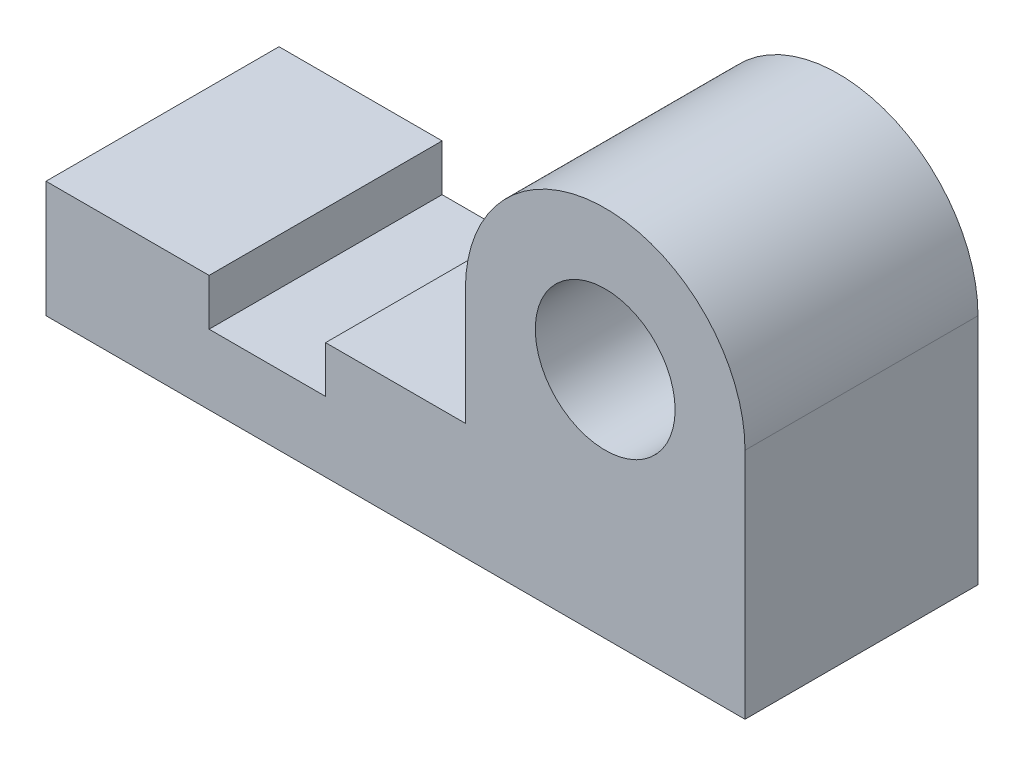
ISO-10303-21;
HEADER;
FILE_DESCRIPTION(('STEP AP214'),'2;1');
FILE_NAME('part.step','',(''),(''),'','','');
FILE_SCHEMA(('AUTOMOTIVE_DESIGN { 1 0 10303 214 1 1 1 1 }'));
ENDSEC;
DATA;
#1=APPLICATION_CONTEXT('core data for automotive mechanical design processes');
#2=APPLICATION_PROTOCOL_DEFINITION('international standard','automotive_design',2000,#1);
#3=PRODUCT_CONTEXT('',#1,'mechanical');
#4=PRODUCT('Part','Part','',(#3));
#5=PRODUCT_RELATED_PRODUCT_CATEGORY('part','',(#4));
#6=PRODUCT_DEFINITION_FORMATION('','',#4);
#7=PRODUCT_DEFINITION_CONTEXT('part definition',#1,'design');
#8=PRODUCT_DEFINITION('design','',#6,#7);
#9=PRODUCT_DEFINITION_SHAPE('','',#8);
#10=(LENGTH_UNIT() NAMED_UNIT(*) SI_UNIT(.MILLI.,.METRE.));
#11=(NAMED_UNIT(*) PLANE_ANGLE_UNIT() SI_UNIT($,.RADIAN.));
#12=(NAMED_UNIT(*) SI_UNIT($,.STERADIAN.) SOLID_ANGLE_UNIT());
#13=UNCERTAINTY_MEASURE_WITH_UNIT(LENGTH_MEASURE(1.E-05),#10,'distance_accuracy_value','');
#14=(GEOMETRIC_REPRESENTATION_CONTEXT(3) GLOBAL_UNCERTAINTY_ASSIGNED_CONTEXT((#13)) GLOBAL_UNIT_ASSIGNED_CONTEXT((#10,
#11,#12)) REPRESENTATION_CONTEXT('',''));
#15=CARTESIAN_POINT('',(0.,0.,0.));
#16=DIRECTION('',(0.,0.,1.));
#17=DIRECTION('',(1.,0.,0.));
#18=AXIS2_PLACEMENT_3D('',#15,#16,#17);
#19=CARTESIAN_POINT('',(240.,100.,100.));
#20=DIRECTION('',(0.,0.,1.));
#21=DIRECTION('',(1.,0.,0.));
#22=AXIS2_PLACEMENT_3D('',#19,#20,#21);
#23=PLANE('',#22);
#24=DIRECTION('',(0.,-1.,0.));
#25=VECTOR('',#24,1.);
#26=CARTESIAN_POINT('',(0.,50.,100.));
#27=LINE('',#26,#25);
#28=CARTESIAN_POINT('',(0.,50.,100.));
#29=VERTEX_POINT('',#28);
#30=CARTESIAN_POINT('',(0.,0.,100.));
#31=VERTEX_POINT('',#30);
#32=EDGE_CURVE('E163',#29,#31,#27,.T.);
#33=ORIENTED_EDGE('',*,*,#32,.T.);
#34=DIRECTION('',(1.,0.,0.));
#35=VECTOR('',#34,1.);
#36=CARTESIAN_POINT('',(0.,0.,100.));
#37=LINE('',#36,#35);
#38=CARTESIAN_POINT('',(300.,0.,100.));
#39=VERTEX_POINT('',#38);
#40=EDGE_CURVE('E101',#31,#39,#37,.T.);
#41=ORIENTED_EDGE('',*,*,#40,.T.);
#42=DIRECTION('',(0.,1.,0.));
#43=VECTOR('',#42,1.);
#44=CARTESIAN_POINT('',(300.,0.,100.));
#45=LINE('',#44,#43);
#46=CARTESIAN_POINT('',(300.,100.,100.));
#47=VERTEX_POINT('',#46);
#48=EDGE_CURVE('E184',#39,#47,#45,.T.);
#49=ORIENTED_EDGE('',*,*,#48,.T.);
#50=CARTESIAN_POINT('',(240.,100.,100.));
#51=DIRECTION('',(0.,0.,1.));
#52=DIRECTION('',(1.,0.,0.));
#53=AXIS2_PLACEMENT_3D('',#50,#51,#52);
#54=CIRCLE('',#53,60.);
#55=CARTESIAN_POINT('',(180.,100.,100.));
#56=VERTEX_POINT('',#55);
#57=EDGE_CURVE('E203',#47,#56,#54,.T.);
#58=ORIENTED_EDGE('',*,*,#57,.T.);
#59=DIRECTION('',(0.,-1.,0.));
#60=VECTOR('',#59,1.);
#61=CARTESIAN_POINT('',(180.,100.,100.));
#62=LINE('',#61,#60);
#63=CARTESIAN_POINT('',(180.,50.,100.));
#64=VERTEX_POINT('',#63);
#65=EDGE_CURVE('E200',#56,#64,#62,.T.);
#66=ORIENTED_EDGE('',*,*,#65,.T.);
#67=DIRECTION('',(-1.,0.,0.));
#68=VECTOR('',#67,1.);
#69=CARTESIAN_POINT('',(180.,50.,100.));
#70=LINE('',#69,#68);
#71=CARTESIAN_POINT('',(120.,50.,100.));
#72=VERTEX_POINT('',#71);
#73=EDGE_CURVE('E202',#64,#72,#70,.T.);
#74=ORIENTED_EDGE('',*,*,#73,.T.);
#75=DIRECTION('',(0.,-1.,0.));
#76=VECTOR('',#75,1.);
#77=CARTESIAN_POINT('',(120.,50.,100.));
#78=LINE('',#77,#76);
#79=CARTESIAN_POINT('',(120.,30.,100.));
#80=VERTEX_POINT('',#79);
#81=EDGE_CURVE('E126',#72,#80,#78,.T.);
#82=ORIENTED_EDGE('',*,*,#81,.T.);
#83=DIRECTION('',(-1.,0.,0.));
#84=VECTOR('',#83,1.);
#85=CARTESIAN_POINT('',(120.,30.,100.));
#86=LINE('',#85,#84);
#87=CARTESIAN_POINT('',(70.,30.,100.));
#88=VERTEX_POINT('',#87);
#89=EDGE_CURVE('E120',#80,#88,#86,.T.);
#90=ORIENTED_EDGE('',*,*,#89,.T.);
#91=DIRECTION('',(0.,1.,0.));
#92=VECTOR('',#91,1.);
#93=CARTESIAN_POINT('',(70.,30.,100.));
#94=LINE('',#93,#92);
#95=CARTESIAN_POINT('',(70.,50.,100.));
#96=VERTEX_POINT('',#95);
#97=EDGE_CURVE('E124',#88,#96,#94,.T.);
#98=ORIENTED_EDGE('',*,*,#97,.T.);
#99=DIRECTION('',(-1.,0.,0.));
#100=VECTOR('',#99,1.);
#101=CARTESIAN_POINT('',(70.,50.,100.));
#102=LINE('',#101,#100);
#103=EDGE_CURVE('E52',#96,#29,#102,.T.);
#104=ORIENTED_EDGE('',*,*,#103,.T.);
#105=EDGE_LOOP('',(#33,#41,#49,#58,#66,#74,#82,#90,#98,#104));
#106=FACE_BOUND('',#105,.T.);
#107=CARTESIAN_POINT('',(240.,100.,100.));
#108=DIRECTION('',(0.,0.,1.));
#109=DIRECTION('',(1.,0.,0.));
#110=AXIS2_PLACEMENT_3D('',#107,#108,#109);
#111=CIRCLE('',#110,30.);
#112=CARTESIAN_POINT('',(270.,100.,100.));
#113=VERTEX_POINT('',#112);
#114=EDGE_CURVE('E148',#113,#113,#111,.T.);
#115=ORIENTED_EDGE('',*,*,#114,.F.);
#116=EDGE_LOOP('',(#115));
#117=FACE_BOUND('',#116,.T.);
#118=ADVANCED_FACE('F35',(#106,#117),#23,.T.);
#119=CARTESIAN_POINT('',(240.,100.,0.));
#120=DIRECTION('',(0.,0.,1.));
#121=DIRECTION('',(1.,0.,0.));
#122=AXIS2_PLACEMENT_3D('',#119,#120,#121);
#123=PLANE('',#122);
#124=DIRECTION('',(0.,-1.,0.));
#125=VECTOR('',#124,1.);
#126=CARTESIAN_POINT('',(0.,50.,0.));
#127=LINE('',#126,#125);
#128=CARTESIAN_POINT('',(0.,50.,0.));
#129=VERTEX_POINT('',#128);
#130=CARTESIAN_POINT('',(0.,0.,0.));
#131=VERTEX_POINT('',#130);
#132=EDGE_CURVE('E144',#129,#131,#127,.T.);
#133=ORIENTED_EDGE('',*,*,#132,.F.);
#134=DIRECTION('',(-1.,0.,0.));
#135=VECTOR('',#134,1.);
#136=CARTESIAN_POINT('',(70.,50.,0.));
#137=LINE('',#136,#135);
#138=CARTESIAN_POINT('',(70.,50.,0.));
#139=VERTEX_POINT('',#138);
#140=EDGE_CURVE('E93',#139,#129,#137,.T.);
#141=ORIENTED_EDGE('',*,*,#140,.F.);
#142=DIRECTION('',(0.,1.,0.));
#143=VECTOR('',#142,1.);
#144=CARTESIAN_POINT('',(70.,30.,0.));
#145=LINE('',#144,#143);
#146=CARTESIAN_POINT('',(70.,30.,0.));
#147=VERTEX_POINT('',#146);
#148=EDGE_CURVE('E87',#147,#139,#145,.T.);
#149=ORIENTED_EDGE('',*,*,#148,.F.);
#150=DIRECTION('',(-1.,0.,0.));
#151=VECTOR('',#150,1.);
#152=CARTESIAN_POINT('',(120.,30.,0.));
#153=LINE('',#152,#151);
#154=CARTESIAN_POINT('',(120.,30.,0.));
#155=VERTEX_POINT('',#154);
#156=EDGE_CURVE('E134',#155,#147,#153,.T.);
#157=ORIENTED_EDGE('',*,*,#156,.F.);
#158=DIRECTION('',(0.,-1.,0.));
#159=VECTOR('',#158,1.);
#160=CARTESIAN_POINT('',(120.,50.,0.));
#161=LINE('',#160,#159);
#162=CARTESIAN_POINT('',(120.,50.,0.));
#163=VERTEX_POINT('',#162);
#164=EDGE_CURVE('E158',#163,#155,#161,.T.);
#165=ORIENTED_EDGE('',*,*,#164,.F.);
#166=DIRECTION('',(-1.,0.,0.));
#167=VECTOR('',#166,1.);
#168=CARTESIAN_POINT('',(180.,50.,0.));
#169=LINE('',#168,#167);
#170=CARTESIAN_POINT('',(180.,50.,0.));
#171=VERTEX_POINT('',#170);
#172=EDGE_CURVE('E156',#171,#163,#169,.T.);
#173=ORIENTED_EDGE('',*,*,#172,.F.);
#174=DIRECTION('',(0.,-1.,0.));
#175=VECTOR('',#174,1.);
#176=CARTESIAN_POINT('',(180.,100.,0.));
#177=LINE('',#176,#175);
#178=CARTESIAN_POINT('',(180.,100.,0.));
#179=VERTEX_POINT('',#178);
#180=EDGE_CURVE('E154',#179,#171,#177,.T.);
#181=ORIENTED_EDGE('',*,*,#180,.F.);
#182=CARTESIAN_POINT('',(240.,100.,0.));
#183=DIRECTION('',(0.,0.,1.));
#184=DIRECTION('',(1.,0.,0.));
#185=AXIS2_PLACEMENT_3D('',#182,#183,#184);
#186=CIRCLE('',#185,60.);
#187=CARTESIAN_POINT('',(300.,100.,0.));
#188=VERTEX_POINT('',#187);
#189=EDGE_CURVE('E152',#188,#179,#186,.T.);
#190=ORIENTED_EDGE('',*,*,#189,.F.);
#191=DIRECTION('',(0.,1.,0.));
#192=VECTOR('',#191,1.);
#193=CARTESIAN_POINT('',(300.,0.,0.));
#194=LINE('',#193,#192);
#195=CARTESIAN_POINT('',(300.,0.,0.));
#196=VERTEX_POINT('',#195);
#197=EDGE_CURVE('E150',#196,#188,#194,.T.);
#198=ORIENTED_EDGE('',*,*,#197,.F.);
#199=DIRECTION('',(1.,0.,0.));
#200=VECTOR('',#199,1.);
#201=CARTESIAN_POINT('',(0.,0.,0.));
#202=LINE('',#201,#200);
#203=EDGE_CURVE('E147',#131,#196,#202,.T.);
#204=ORIENTED_EDGE('',*,*,#203,.F.);
#205=EDGE_LOOP('',(#133,#141,#149,#157,#165,#173,#181,#190,#198,#204));
#206=FACE_BOUND('',#205,.T.);
#207=CARTESIAN_POINT('',(240.,100.,0.));
#208=DIRECTION('',(0.,0.,1.));
#209=DIRECTION('',(1.,0.,0.));
#210=AXIS2_PLACEMENT_3D('',#207,#208,#209);
#211=CIRCLE('',#210,30.);
#212=CARTESIAN_POINT('',(270.,100.,0.));
#213=VERTEX_POINT('',#212);
#214=EDGE_CURVE('E211',#213,#213,#211,.T.);
#215=ORIENTED_EDGE('',*,*,#214,.T.);
#216=EDGE_LOOP('',(#215));
#217=FACE_BOUND('',#216,.T.);
#218=ADVANCED_FACE('F188',(#206,#217),#123,.F.);
#219=CARTESIAN_POINT('',(0.,50.,100.));
#220=DIRECTION('',(1.,0.,0.));
#221=DIRECTION('',(0.,1.,0.));
#222=AXIS2_PLACEMENT_3D('',#219,#220,#221);
#223=PLANE('',#222);
#224=ORIENTED_EDGE('',*,*,#132,.T.);
#225=DIRECTION('',(0.,0.,-1.));
#226=VECTOR('',#225,1.);
#227=CARTESIAN_POINT('',(0.,0.,100.));
#228=LINE('',#227,#226);
#229=EDGE_CURVE('E11',#31,#131,#228,.T.);
#230=ORIENTED_EDGE('',*,*,#229,.F.);
#231=ORIENTED_EDGE('',*,*,#32,.F.);
#232=DIRECTION('',(0.,0.,-1.));
#233=VECTOR('',#232,1.);
#234=CARTESIAN_POINT('',(0.,50.,100.));
#235=LINE('',#234,#233);
#236=EDGE_CURVE('E140',#29,#129,#235,.T.);
#237=ORIENTED_EDGE('',*,*,#236,.T.);
#238=EDGE_LOOP('',(#224,#230,#231,#237));
#239=FACE_BOUND('',#238,.T.);
#240=ADVANCED_FACE('F37',(#239),#223,.F.);
#241=CARTESIAN_POINT('',(0.,0.,100.));
#242=DIRECTION('',(0.,1.,0.));
#243=DIRECTION('',(0.,0.,1.));
#244=AXIS2_PLACEMENT_3D('',#241,#242,#243);
#245=PLANE('',#244);
#246=ORIENTED_EDGE('',*,*,#203,.T.);
#247=DIRECTION('',(0.,0.,-1.));
#248=VECTOR('',#247,1.);
#249=CARTESIAN_POINT('',(300.,0.,100.));
#250=LINE('',#249,#248);
#251=EDGE_CURVE('E44',#39,#196,#250,.T.);
#252=ORIENTED_EDGE('',*,*,#251,.F.);
#253=ORIENTED_EDGE('',*,*,#40,.F.);
#254=ORIENTED_EDGE('',*,*,#229,.T.);
#255=EDGE_LOOP('',(#246,#252,#253,#254));
#256=FACE_BOUND('',#255,.T.);
#257=ADVANCED_FACE('F247',(#256),#245,.F.);
#258=CARTESIAN_POINT('',(300.,0.,100.));
#259=DIRECTION('',(-1.,0.,0.));
#260=DIRECTION('',(0.,-1.,0.));
#261=AXIS2_PLACEMENT_3D('',#258,#259,#260);
#262=PLANE('',#261);
#263=ORIENTED_EDGE('',*,*,#197,.T.);
#264=DIRECTION('',(0.,0.,-1.));
#265=VECTOR('',#264,1.);
#266=CARTESIAN_POINT('',(300.,100.,100.));
#267=LINE('',#266,#265);
#268=EDGE_CURVE('E176',#47,#188,#267,.T.);
#269=ORIENTED_EDGE('',*,*,#268,.F.);
#270=ORIENTED_EDGE('',*,*,#48,.F.);
#271=ORIENTED_EDGE('',*,*,#251,.T.);
#272=EDGE_LOOP('',(#263,#269,#270,#271));
#273=FACE_BOUND('',#272,.T.);
#274=ADVANCED_FACE('F182',(#273),#262,.F.);
#275=CARTESIAN_POINT('',(240.,100.,100.));
#276=DIRECTION('',(0.,0.,-1.));
#277=DIRECTION('',(-1.,0.,0.));
#278=AXIS2_PLACEMENT_3D('',#275,#276,#277);
#279=CYLINDRICAL_SURFACE('',#278,60.);
#280=ORIENTED_EDGE('',*,*,#189,.T.);
#281=DIRECTION('',(0.,0.,-1.));
#282=VECTOR('',#281,1.);
#283=CARTESIAN_POINT('',(180.,100.,100.));
#284=LINE('',#283,#282);
#285=EDGE_CURVE('E173',#56,#179,#284,.T.);
#286=ORIENTED_EDGE('',*,*,#285,.F.);
#287=ORIENTED_EDGE('',*,*,#57,.F.);
#288=ORIENTED_EDGE('',*,*,#268,.T.);
#289=EDGE_LOOP('',(#280,#286,#287,#288));
#290=FACE_BOUND('',#289,.T.);
#291=ADVANCED_FACE('F194',(#290),#279,.T.);
#292=CARTESIAN_POINT('',(180.,100.,100.));
#293=DIRECTION('',(1.,0.,0.));
#294=DIRECTION('',(0.,0.,-1.));
#295=AXIS2_PLACEMENT_3D('',#292,#293,#294);
#296=PLANE('',#295);
#297=ORIENTED_EDGE('',*,*,#180,.T.);
#298=DIRECTION('',(0.,0.,-1.));
#299=VECTOR('',#298,1.);
#300=CARTESIAN_POINT('',(180.,50.,100.));
#301=LINE('',#300,#299);
#302=EDGE_CURVE('E170',#64,#171,#301,.T.);
#303=ORIENTED_EDGE('',*,*,#302,.F.);
#304=ORIENTED_EDGE('',*,*,#65,.F.);
#305=ORIENTED_EDGE('',*,*,#285,.T.);
#306=EDGE_LOOP('',(#297,#303,#304,#305));
#307=FACE_BOUND('',#306,.T.);
#308=ADVANCED_FACE('F198',(#307),#296,.F.);
#309=CARTESIAN_POINT('',(180.,50.,100.));
#310=DIRECTION('',(0.,-1.,0.));
#311=DIRECTION('',(1.,0.,0.));
#312=AXIS2_PLACEMENT_3D('',#309,#310,#311);
#313=PLANE('',#312);
#314=ORIENTED_EDGE('',*,*,#172,.T.);
#315=DIRECTION('',(0.,0.,-1.));
#316=VECTOR('',#315,1.);
#317=CARTESIAN_POINT('',(120.,50.,100.));
#318=LINE('',#317,#316);
#319=EDGE_CURVE('E167',#72,#163,#318,.T.);
#320=ORIENTED_EDGE('',*,*,#319,.F.);
#321=ORIENTED_EDGE('',*,*,#73,.F.);
#322=ORIENTED_EDGE('',*,*,#302,.T.);
#323=EDGE_LOOP('',(#314,#320,#321,#322));
#324=FACE_BOUND('',#323,.T.);
#325=ADVANCED_FACE('F237',(#324),#313,.F.);
#326=CARTESIAN_POINT('',(120.,50.,100.));
#327=DIRECTION('',(1.,0.,0.));
#328=DIRECTION('',(0.,0.,-1.));
#329=AXIS2_PLACEMENT_3D('',#326,#327,#328);
#330=PLANE('',#329);
#331=ORIENTED_EDGE('',*,*,#164,.T.);
#332=DIRECTION('',(0.,0.,-1.));
#333=VECTOR('',#332,1.);
#334=CARTESIAN_POINT('',(120.,30.,100.));
#335=LINE('',#334,#333);
#336=EDGE_CURVE('E135',#80,#155,#335,.T.);
#337=ORIENTED_EDGE('',*,*,#336,.F.);
#338=ORIENTED_EDGE('',*,*,#81,.F.);
#339=ORIENTED_EDGE('',*,*,#319,.T.);
#340=EDGE_LOOP('',(#331,#337,#338,#339));
#341=FACE_BOUND('',#340,.T.);
#342=ADVANCED_FACE('F234',(#341),#330,.F.);
#343=CARTESIAN_POINT('',(120.,30.,100.));
#344=DIRECTION('',(0.,-1.,0.));
#345=DIRECTION('',(1.,0.,0.));
#346=AXIS2_PLACEMENT_3D('',#343,#344,#345);
#347=PLANE('',#346);
#348=ORIENTED_EDGE('',*,*,#156,.T.);
#349=DIRECTION('',(0.,0.,-1.));
#350=VECTOR('',#349,1.);
#351=CARTESIAN_POINT('',(70.,30.,100.));
#352=LINE('',#351,#350);
#353=EDGE_CURVE('E131',#88,#147,#352,.T.);
#354=ORIENTED_EDGE('',*,*,#353,.F.);
#355=ORIENTED_EDGE('',*,*,#89,.F.);
#356=ORIENTED_EDGE('',*,*,#336,.T.);
#357=EDGE_LOOP('',(#348,#354,#355,#356));
#358=FACE_BOUND('',#357,.T.);
#359=ADVANCED_FACE('F132',(#358),#347,.F.);
#360=CARTESIAN_POINT('',(70.,30.,100.));
#361=DIRECTION('',(-1.,0.,0.));
#362=DIRECTION('',(0.,0.,1.));
#363=AXIS2_PLACEMENT_3D('',#360,#361,#362);
#364=PLANE('',#363);
#365=ORIENTED_EDGE('',*,*,#148,.T.);
#366=DIRECTION('',(0.,0.,-1.));
#367=VECTOR('',#366,1.);
#368=CARTESIAN_POINT('',(70.,50.,100.));
#369=LINE('',#368,#367);
#370=EDGE_CURVE('E136',#96,#139,#369,.T.);
#371=ORIENTED_EDGE('',*,*,#370,.F.);
#372=ORIENTED_EDGE('',*,*,#97,.F.);
#373=ORIENTED_EDGE('',*,*,#353,.T.);
#374=EDGE_LOOP('',(#365,#371,#372,#373));
#375=FACE_BOUND('',#374,.T.);
#376=ADVANCED_FACE('F138',(#375),#364,.F.);
#377=CARTESIAN_POINT('',(70.,50.,100.));
#378=DIRECTION('',(0.,-1.,0.));
#379=DIRECTION('',(1.,0.,0.));
#380=AXIS2_PLACEMENT_3D('',#377,#378,#379);
#381=PLANE('',#380);
#382=ORIENTED_EDGE('',*,*,#140,.T.);
#383=ORIENTED_EDGE('',*,*,#236,.F.);
#384=ORIENTED_EDGE('',*,*,#103,.F.);
#385=ORIENTED_EDGE('',*,*,#370,.T.);
#386=EDGE_LOOP('',(#382,#383,#384,#385));
#387=FACE_BOUND('',#386,.T.);
#388=ADVANCED_FACE('F227',(#387),#381,.F.);
#389=CARTESIAN_POINT('',(240.,100.,100.));
#390=DIRECTION('',(0.,0.,-1.));
#391=DIRECTION('',(-1.,0.,0.));
#392=AXIS2_PLACEMENT_3D('',#389,#390,#391);
#393=CYLINDRICAL_SURFACE('',#392,30.);
#394=ORIENTED_EDGE('',*,*,#114,.T.);
#395=EDGE_LOOP('',(#394));
#396=FACE_BOUND('',#395,.T.);
#397=ORIENTED_EDGE('',*,*,#214,.F.);
#398=EDGE_LOOP('',(#397));
#399=FACE_BOUND('',#398,.T.);
#400=ADVANCED_FACE('F217',(#396,#399),#393,.F.);
#401=CLOSED_SHELL('',(#118,#218,#240,#257,#274,#291,#308,#325,#342,#359,#376,#388,#400));
#402=MANIFOLD_SOLID_BREP('B2',#401);
#403=ADVANCED_BREP_SHAPE_REPRESENTATION('',(#18,#402),#14);
#404=SHAPE_DEFINITION_REPRESENTATION(#9,#403);
ENDSEC;
END-ISO-10303-21;
